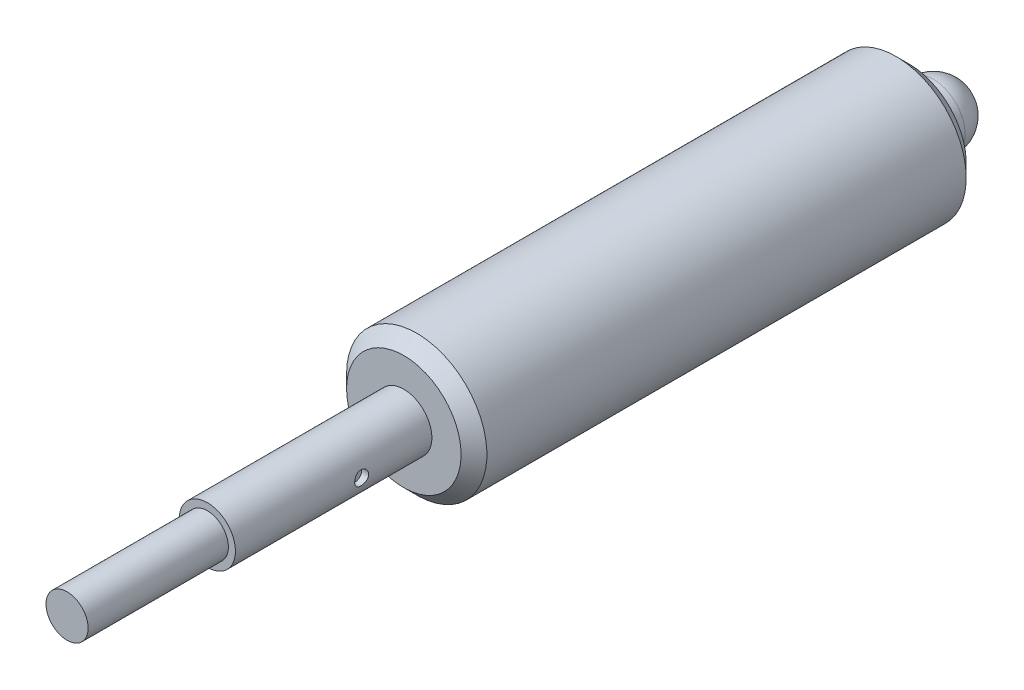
ISO-10303-21;
HEADER;
FILE_DESCRIPTION(('STEP AP214'),'2;1');
FILE_NAME('part.step','',(''),(''),'','','');
FILE_SCHEMA(('AUTOMOTIVE_DESIGN { 1 0 10303 214 1 1 1 1 }'));
ENDSEC;
DATA;
#1=APPLICATION_CONTEXT('core data for automotive mechanical design processes');
#2=APPLICATION_PROTOCOL_DEFINITION('international standard','automotive_design',2000,#1);
#3=PRODUCT_CONTEXT('',#1,'mechanical');
#4=PRODUCT('Part','Part','',(#3));
#5=PRODUCT_RELATED_PRODUCT_CATEGORY('part','',(#4));
#6=PRODUCT_DEFINITION_FORMATION('','',#4);
#7=PRODUCT_DEFINITION_CONTEXT('part definition',#1,'design');
#8=PRODUCT_DEFINITION('design','',#6,#7);
#9=PRODUCT_DEFINITION_SHAPE('','',#8);
#10=(LENGTH_UNIT() NAMED_UNIT(*) SI_UNIT(.MILLI.,.METRE.));
#11=(NAMED_UNIT(*) PLANE_ANGLE_UNIT() SI_UNIT($,.RADIAN.));
#12=(NAMED_UNIT(*) SI_UNIT($,.STERADIAN.) SOLID_ANGLE_UNIT());
#13=UNCERTAINTY_MEASURE_WITH_UNIT(LENGTH_MEASURE(1.E-05),#10,'distance_accuracy_value','');
#14=(GEOMETRIC_REPRESENTATION_CONTEXT(3) GLOBAL_UNCERTAINTY_ASSIGNED_CONTEXT((#13)) GLOBAL_UNIT_ASSIGNED_CONTEXT((#10,
#11,#12)) REPRESENTATION_CONTEXT('',''));
#15=CARTESIAN_POINT('',(0.,0.,0.));
#16=DIRECTION('',(0.,0.,1.));
#17=DIRECTION('',(1.,0.,0.));
#18=AXIS2_PLACEMENT_3D('',#15,#16,#17);
#19=CARTESIAN_POINT('',(0.,0.,60.));
#20=DIRECTION('',(0.,0.,-1.));
#21=DIRECTION('',(-1.,0.,0.));
#22=AXIS2_PLACEMENT_3D('',#19,#20,#21);
#23=PLANE('',#22);
#24=CARTESIAN_POINT('',(0.,0.,60.));
#25=DIRECTION('',(0.,0.,-1.));
#26=DIRECTION('',(-1.,0.,0.));
#27=AXIS2_PLACEMENT_3D('',#24,#25,#26);
#28=CIRCLE('',#27,1.5);
#29=CARTESIAN_POINT('',(-1.5,0.,60.));
#30=VERTEX_POINT('',#29);
#31=EDGE_CURVE('E23',#30,#30,#28,.T.);
#32=ORIENTED_EDGE('',*,*,#31,.F.);
#33=EDGE_LOOP('',(#32));
#34=FACE_BOUND('',#33,.T.);
#35=ADVANCED_FACE('F12',(#34),#23,.F.);
#36=CARTESIAN_POINT('',(0.,0.,5.));
#37=DIRECTION('',(0.,0.,-1.));
#38=DIRECTION('',(-1.,0.,0.));
#39=AXIS2_PLACEMENT_3D('',#36,#37,#38);
#40=CYLINDRICAL_SURFACE('',#39,1.5);
#41=CARTESIAN_POINT('',(0.,0.,50.));
#42=DIRECTION('',(0.,0.,-1.));
#43=DIRECTION('',(-1.,0.,0.));
#44=AXIS2_PLACEMENT_3D('',#41,#42,#43);
#45=CIRCLE('',#44,1.5);
#46=CARTESIAN_POINT('',(-1.5,0.,50.));
#47=VERTEX_POINT('',#46);
#48=EDGE_CURVE('E27',#47,#47,#45,.T.);
#49=ORIENTED_EDGE('',*,*,#48,.F.);
#50=EDGE_LOOP('',(#49));
#51=FACE_BOUND('',#50,.T.);
#52=ORIENTED_EDGE('',*,*,#31,.T.);
#53=EDGE_LOOP('',(#52));
#54=FACE_BOUND('',#53,.T.);
#55=ADVANCED_FACE('F78',(#51,#54),#40,.T.);
#56=CARTESIAN_POINT('',(0.,1.5,50.));
#57=DIRECTION('',(0.,0.,-1.));
#58=DIRECTION('',(-1.,0.,0.));
#59=AXIS2_PLACEMENT_3D('',#56,#57,#58);
#60=PLANE('',#59);
#61=CARTESIAN_POINT('',(0.,0.,50.));
#62=DIRECTION('',(0.,0.,-1.));
#63=DIRECTION('',(-1.,0.,0.));
#64=AXIS2_PLACEMENT_3D('',#61,#62,#63);
#65=CIRCLE('',#64,2.);
#66=CARTESIAN_POINT('',(-2.,0.,50.));
#67=VERTEX_POINT('',#66);
#68=EDGE_CURVE('E31',#67,#67,#65,.T.);
#69=ORIENTED_EDGE('',*,*,#68,.F.);
#70=EDGE_LOOP('',(#69));
#71=FACE_BOUND('',#70,.T.);
#72=ORIENTED_EDGE('',*,*,#48,.T.);
#73=EDGE_LOOP('',(#72));
#74=FACE_BOUND('',#73,.T.);
#75=ADVANCED_FACE('F83',(#71,#74),#60,.F.);
#76=CARTESIAN_POINT('',(0.,0.,5.));
#77=DIRECTION('',(0.,0.,-1.));
#78=DIRECTION('',(-1.,0.,0.));
#79=AXIS2_PLACEMENT_3D('',#76,#77,#78);
#80=CYLINDRICAL_SURFACE('',#79,2.);
#81=CARTESIAN_POINT('',(0.,0.,36.));
#82=DIRECTION('',(0.,0.,-1.));
#83=DIRECTION('',(-1.,0.,0.));
#84=AXIS2_PLACEMENT_3D('',#81,#82,#83);
#85=CIRCLE('',#84,2.);
#86=CARTESIAN_POINT('',(-2.,0.,36.));
#87=VERTEX_POINT('',#86);
#88=EDGE_CURVE('E36',#87,#87,#85,.T.);
#89=ORIENTED_EDGE('',*,*,#88,.F.);
#90=EDGE_LOOP('',(#89));
#91=FACE_BOUND('',#90,.T.);
#92=CARTESIAN_POINT('',(2.,0.,40.5));
#93=CARTESIAN_POINT('',(1.99999953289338,-0.027625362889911,40.5000007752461));
#94=CARTESIAN_POINT('',(1.99942192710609,-0.0552593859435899,40.5022971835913));
#95=CARTESIAN_POINT('',(1.99717371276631,-0.109735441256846,40.511408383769));
#96=CARTESIAN_POINT('',(1.99550248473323,-0.136577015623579,40.5182257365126));
#97=CARTESIAN_POINT('',(1.99125208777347,-0.188673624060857,40.5361464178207));
#98=CARTESIAN_POINT('',(1.98867400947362,-0.213930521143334,40.5472445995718));
#99=CARTESIAN_POINT('',(1.98288447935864,-0.262224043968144,40.5733937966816));
#100=CARTESIAN_POINT('',(1.97967300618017,-0.285260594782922,40.588444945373));
#101=CARTESIAN_POINT('',(1.97289137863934,-0.32893397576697,40.6224002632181));
#102=CARTESIAN_POINT('',(1.96931569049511,-0.349518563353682,40.6413705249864));
#103=CARTESIAN_POINT('',(1.96224540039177,-0.387249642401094,40.682484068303));
#104=CARTESIAN_POINT('',(1.95875080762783,-0.40439574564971,40.7046277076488));
#105=CARTESIAN_POINT('',(1.9521825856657,-0.435008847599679,40.7518650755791));
#106=CARTESIAN_POINT('',(1.94911598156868,-0.44841740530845,40.7769977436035));
#107=CARTESIAN_POINT('',(1.94383164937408,-0.47079896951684,40.8292494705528));
#108=CARTESIAN_POINT('',(1.94161378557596,-0.479772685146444,40.8563682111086));
#109=CARTESIAN_POINT('',(1.93833492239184,-0.492851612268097,40.9112478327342));
#110=CARTESIAN_POINT('',(1.93725163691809,-0.497050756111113,40.9389849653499));
#111=CARTESIAN_POINT('',(1.9362978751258,-0.500753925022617,40.9947895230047));
#112=CARTESIAN_POINT('',(1.93642720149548,-0.500258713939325,41.0228568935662));
#113=CARTESIAN_POINT('',(1.93786401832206,-0.494662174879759,41.0778052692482));
#114=CARTESIAN_POINT('',(1.93914287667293,-0.489672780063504,41.1046985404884));
#115=CARTESIAN_POINT('',(1.94268903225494,-0.475408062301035,41.1572536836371));
#116=CARTESIAN_POINT('',(1.94495639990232,-0.466132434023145,41.1829154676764));
#117=CARTESIAN_POINT('',(1.95025037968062,-0.443463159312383,41.2325793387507));
#118=CARTESIAN_POINT('',(1.95328442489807,-0.430028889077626,41.2565620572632));
#119=CARTESIAN_POINT('',(1.95976570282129,-0.399452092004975,41.3019729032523));
#120=CARTESIAN_POINT('',(1.96321300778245,-0.382308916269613,41.3234005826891));
#121=CARTESIAN_POINT('',(1.9702529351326,-0.34422114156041,41.3637345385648));
#122=CARTESIAN_POINT('',(1.97384689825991,-0.323182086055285,41.3825514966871));
#123=CARTESIAN_POINT('',(1.98068655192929,-0.278203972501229,41.4164070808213));
#124=CARTESIAN_POINT('',(1.98393223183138,-0.254264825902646,41.4314455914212));
#125=CARTESIAN_POINT('',(1.98972577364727,-0.204038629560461,41.4573501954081));
#126=CARTESIAN_POINT('',(1.99227120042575,-0.177743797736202,41.4682017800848));
#127=CARTESIAN_POINT('',(1.99635972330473,-0.123625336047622,41.4853057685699));
#128=CARTESIAN_POINT('',(1.99790301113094,-0.095801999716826,41.4915590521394));
#129=CARTESIAN_POINT('',(1.99978499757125,-0.0401799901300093,41.499152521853));
#130=CARTESIAN_POINT('',(2.00015351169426,-0.0123989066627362,41.5006143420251));
#131=CARTESIAN_POINT('',(1.9997293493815,0.0430109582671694,41.4989169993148));
#132=CARTESIAN_POINT('',(1.99893677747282,0.0706397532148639,41.4957582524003));
#133=CARTESIAN_POINT('',(1.99629860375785,0.124538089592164,41.4850096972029));
#134=CARTESIAN_POINT('',(1.99446878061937,0.15082170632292,41.4774862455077));
#135=CARTESIAN_POINT('',(1.98996235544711,0.201752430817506,41.4582976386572));
#136=CARTESIAN_POINT('',(1.98728566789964,0.22639937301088,41.446632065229));
#137=CARTESIAN_POINT('',(1.98131102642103,0.273841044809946,41.4192546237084));
#138=CARTESIAN_POINT('',(1.97800289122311,0.296595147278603,41.4034746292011));
#139=CARTESIAN_POINT('',(1.97114836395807,0.339175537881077,41.3684033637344));
#140=CARTESIAN_POINT('',(1.96760193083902,0.35900131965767,41.3491114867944));
#141=CARTESIAN_POINT('',(1.96056318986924,0.395663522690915,41.3069993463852));
#142=CARTESIAN_POINT('',(1.95707434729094,0.412414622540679,41.2841040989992));
#143=CARTESIAN_POINT('',(1.95064292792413,0.441836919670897,41.2357557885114));
#144=CARTESIAN_POINT('',(1.94770032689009,0.454508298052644,41.2103028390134));
#145=CARTESIAN_POINT('',(1.94272698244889,0.475317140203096,41.157698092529));
#146=CARTESIAN_POINT('',(1.94069085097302,0.483481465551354,41.1305574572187));
#147=CARTESIAN_POINT('',(1.93775581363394,0.495115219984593,41.0752301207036));
#148=CARTESIAN_POINT('',(1.93685665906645,0.498585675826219,41.0470436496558));
#149=CARTESIAN_POINT('',(1.93631633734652,0.500679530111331,40.9912929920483));
#150=CARTESIAN_POINT('',(1.93663977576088,0.49943929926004,40.9637341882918));
#151=CARTESIAN_POINT('',(1.93842636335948,0.492459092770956,40.9092320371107));
#152=CARTESIAN_POINT('',(1.93988948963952,0.486719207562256,40.8822886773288));
#153=CARTESIAN_POINT('',(1.94377086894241,0.470977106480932,40.8299305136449));
#154=CARTESIAN_POINT('',(1.94618338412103,0.461000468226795,40.8045075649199));
#155=CARTESIAN_POINT('',(1.95169251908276,0.437088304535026,40.7556782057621));
#156=CARTESIAN_POINT('',(1.95478923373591,0.423152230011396,40.7322720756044));
#157=CARTESIAN_POINT('',(1.96141878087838,0.391289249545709,40.6874817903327));
#158=CARTESIAN_POINT('',(1.96496088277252,0.373267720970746,40.6661663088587));
#159=CARTESIAN_POINT('',(1.97202675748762,0.333929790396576,40.6268176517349));
#160=CARTESIAN_POINT('',(1.97555052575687,0.31261260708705,40.608785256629));
#161=CARTESIAN_POINT('',(1.98225885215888,0.266822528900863,40.5761962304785));
#162=CARTESIAN_POINT('',(1.98543611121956,0.242299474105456,40.5617084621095));
#163=CARTESIAN_POINT('',(1.99101641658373,0.191088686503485,40.5370841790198));
#164=CARTESIAN_POINT('',(1.99342001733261,0.164402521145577,40.5269445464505));
#165=CARTESIAN_POINT('',(1.99682686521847,0.114803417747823,40.5128093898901));
#166=CARTESIAN_POINT('',(1.9980086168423,0.0921267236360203,40.5080162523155));
#167=CARTESIAN_POINT('',(1.99959535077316,0.0463020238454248,40.501611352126));
#168=CARTESIAN_POINT('',(2.00000039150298,0.0231540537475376,40.4999993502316));
#169=CARTESIAN_POINT('',(2.,0.,40.5));
#170=B_SPLINE_CURVE_WITH_KNOTS('',3,(#92,#93,#94,#95,#96,#97,#98,#99,#100,#101,#102,#103,#104,
#105,#106,#107,#108,#109,#110,#111,#112,#113,#114,#115,#116,#117,#118,#119,#120,#121,#122,#123,
#124,#125,#126,#127,#128,#129,#130,#131,#132,#133,#134,#135,#136,#137,#138,#139,#140,#141,#142,
#143,#144,#145,#146,#147,#148,#149,#150,#151,#152,#153,#154,#155,#156,#157,#158,#159,#160,#161,
#162,#163,#164,#165,#166,#167,#168,#169),.UNSPECIFIED.,.T.,.F.,(4,2,2,2,2,2,2,2,2,2,2,2,2,2,2,2,
2,2,2,2,2,2,2,2,2,2,2,2,2,2,2,2,2,2,2,2,2,2,4),(0.,0.0827912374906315,0.165629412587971,
0.248368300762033,0.331109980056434,0.415381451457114,0.499662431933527,0.585195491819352,
0.670714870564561,0.754520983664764,0.838313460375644,0.920074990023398,1.00184234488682,
1.08443509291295,1.16704230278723,1.25200500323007,1.33697029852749,1.42222743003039,
1.50746824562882,1.59052769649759,1.67357967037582,1.7554009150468,1.83723042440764,
1.92051195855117,2.00380787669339,2.08914836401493,2.17448506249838,2.25930751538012,
2.34411141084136,2.42647926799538,2.50884546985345,2.59072133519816,2.67260856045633,
2.75663192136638,2.84067523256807,2.92624061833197,3.01174454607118,3.08114080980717,
3.1505318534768),.UNSPECIFIED.);
#171=CARTESIAN_POINT('',(2.,0.,40.5));
#172=VERTEX_POINT('',#171);
#173=EDGE_CURVE('E8',#172,#172,#170,.T.);
#174=ORIENTED_EDGE('',*,*,#173,.T.);
#175=EDGE_LOOP('',(#174));
#176=FACE_BOUND('',#175,.T.);
#177=ORIENTED_EDGE('',*,*,#68,.T.);
#178=EDGE_LOOP('',(#177));
#179=FACE_BOUND('',#178,.T.);
#180=ADVANCED_FACE('F88',(#91,#176,#179),#80,.T.);
#181=CARTESIAN_POINT('',(0.,2.,36.));
#182=DIRECTION('',(0.,0.,-1.));
#183=DIRECTION('',(-1.,0.,0.));
#184=AXIS2_PLACEMENT_3D('',#181,#182,#183);
#185=PLANE('',#184);
#186=CARTESIAN_POINT('',(0.,0.,36.));
#187=DIRECTION('',(0.,0.,-1.));
#188=DIRECTION('',(-1.,0.,0.));
#189=AXIS2_PLACEMENT_3D('',#186,#187,#188);
#190=CIRCLE('',#189,4.08);
#191=CARTESIAN_POINT('',(-4.08,0.,36.));
#192=VERTEX_POINT('',#191);
#193=EDGE_CURVE('E39',#192,#192,#190,.T.);
#194=ORIENTED_EDGE('',*,*,#193,.F.);
#195=EDGE_LOOP('',(#194));
#196=FACE_BOUND('',#195,.T.);
#197=ORIENTED_EDGE('',*,*,#88,.T.);
#198=EDGE_LOOP('',(#197));
#199=FACE_BOUND('',#198,.T.);
#200=ADVANCED_FACE('F95',(#196,#199),#185,.F.);
#201=CARTESIAN_POINT('',(0.,0.,36.));
#202=DIRECTION('',(0.,0.,-1.));
#203=DIRECTION('',(-1.,0.,0.));
#204=AXIS2_PLACEMENT_3D('',#201,#202,#203);
#205=CONICAL_SURFACE('',#204,4.08,0.785398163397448);
#206=CARTESIAN_POINT('',(0.,0.,35.08));
#207=DIRECTION('',(0.,0.,-1.));
#208=DIRECTION('',(-1.,0.,0.));
#209=AXIS2_PLACEMENT_3D('',#206,#207,#208);
#210=CIRCLE('',#209,5.);
#211=CARTESIAN_POINT('',(-5.,0.,35.08));
#212=VERTEX_POINT('',#211);
#213=EDGE_CURVE('E42',#212,#212,#210,.T.);
#214=ORIENTED_EDGE('',*,*,#213,.F.);
#215=EDGE_LOOP('',(#214));
#216=FACE_BOUND('',#215,.T.);
#217=ORIENTED_EDGE('',*,*,#193,.T.);
#218=EDGE_LOOP('',(#217));
#219=FACE_BOUND('',#218,.T.);
#220=ADVANCED_FACE('F99',(#216,#219),#205,.T.);
#221=CARTESIAN_POINT('',(0.,0.,5.));
#222=DIRECTION('',(0.,0.,-1.));
#223=DIRECTION('',(-1.,0.,0.));
#224=AXIS2_PLACEMENT_3D('',#221,#222,#223);
#225=CYLINDRICAL_SURFACE('',#224,5.);
#226=CARTESIAN_POINT('',(0.,0.,0.92));
#227=DIRECTION('',(0.,0.,-1.));
#228=DIRECTION('',(-1.,0.,0.));
#229=AXIS2_PLACEMENT_3D('',#226,#227,#228);
#230=CIRCLE('',#229,5.);
#231=CARTESIAN_POINT('',(-5.,0.,0.92));
#232=VERTEX_POINT('',#231);
#233=EDGE_CURVE('E45',#232,#232,#230,.T.);
#234=ORIENTED_EDGE('',*,*,#233,.F.);
#235=EDGE_LOOP('',(#234));
#236=FACE_BOUND('',#235,.T.);
#237=ORIENTED_EDGE('',*,*,#213,.T.);
#238=EDGE_LOOP('',(#237));
#239=FACE_BOUND('',#238,.T.);
#240=ADVANCED_FACE('F103',(#236,#239),#225,.T.);
#241=CARTESIAN_POINT('',(0.,0.,0.92));
#242=DIRECTION('',(0.,0.,1.));
#243=DIRECTION('',(1.,0.,0.));
#244=AXIS2_PLACEMENT_3D('',#241,#242,#243);
#245=CONICAL_SURFACE('',#244,5.,0.785398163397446);
#246=CARTESIAN_POINT('',(0.,0.,0.));
#247=DIRECTION('',(0.,0.,-1.));
#248=DIRECTION('',(-1.,0.,0.));
#249=AXIS2_PLACEMENT_3D('',#246,#247,#248);
#250=CIRCLE('',#249,4.08);
#251=CARTESIAN_POINT('',(-4.08,0.,0.));
#252=VERTEX_POINT('',#251);
#253=EDGE_CURVE('E48',#252,#252,#250,.T.);
#254=ORIENTED_EDGE('',*,*,#253,.F.);
#255=EDGE_LOOP('',(#254));
#256=FACE_BOUND('',#255,.T.);
#257=ORIENTED_EDGE('',*,*,#233,.T.);
#258=EDGE_LOOP('',(#257));
#259=FACE_BOUND('',#258,.T.);
#260=ADVANCED_FACE('F107',(#256,#259),#245,.T.);
#261=CARTESIAN_POINT('',(0.,4.08,0.));
#262=DIRECTION('',(0.,0.,1.));
#263=DIRECTION('',(1.,0.,0.));
#264=AXIS2_PLACEMENT_3D('',#261,#262,#263);
#265=PLANE('',#264);
#266=CARTESIAN_POINT('',(0.,0.,0.));
#267=DIRECTION('',(0.,0.,-1.));
#268=DIRECTION('',(-1.,0.,0.));
#269=AXIS2_PLACEMENT_3D('',#266,#267,#268);
#270=CIRCLE('',#269,2.25);
#271=CARTESIAN_POINT('',(-2.25,0.,0.));
#272=VERTEX_POINT('',#271);
#273=EDGE_CURVE('E51',#272,#272,#270,.T.);
#274=ORIENTED_EDGE('',*,*,#273,.F.);
#275=EDGE_LOOP('',(#274));
#276=FACE_BOUND('',#275,.T.);
#277=ORIENTED_EDGE('',*,*,#253,.T.);
#278=EDGE_LOOP('',(#277));
#279=FACE_BOUND('',#278,.T.);
#280=ADVANCED_FACE('F111',(#276,#279),#265,.F.);
#281=CARTESIAN_POINT('',(0.,0.,-4.));
#282=DIRECTION('',(0.,0.,-1.));
#283=DIRECTION('',(-1.,0.,0.));
#284=AXIS2_PLACEMENT_3D('',#281,#282,#283);
#285=CYLINDRICAL_SURFACE('',#284,2.25);
#286=CARTESIAN_POINT('',(0.,0.,-1.75));
#287=DIRECTION('',(0.,0.,-1.));
#288=DIRECTION('',(-1.,0.,0.));
#289=AXIS2_PLACEMENT_3D('',#286,#287,#288);
#290=CIRCLE('',#289,2.25);
#291=CARTESIAN_POINT('',(-2.25,0.,-1.75));
#292=VERTEX_POINT('',#291);
#293=EDGE_CURVE('E54',#292,#292,#290,.T.);
#294=ORIENTED_EDGE('',*,*,#293,.F.);
#295=EDGE_LOOP('',(#294));
#296=FACE_BOUND('',#295,.T.);
#297=ORIENTED_EDGE('',*,*,#273,.T.);
#298=EDGE_LOOP('',(#297));
#299=FACE_BOUND('',#298,.T.);
#300=ADVANCED_FACE('F73',(#296,#299),#285,.T.);
#301=CARTESIAN_POINT('',(0.,0.,-1.75));
#302=DIRECTION('',(0.,0.,-1.));
#303=DIRECTION('',(0.,1.,0.));
#304=AXIS2_PLACEMENT_3D('',#301,#302,#303);
#305=SPHERICAL_SURFACE('',#304,2.25);
#306=ORIENTED_EDGE('',*,*,#293,.T.);
#307=EDGE_LOOP('',(#306));
#308=FACE_BOUND('',#307,.T.);
#309=ADVANCED_FACE('F66',(#308),#305,.T.);
#310=CARTESIAN_POINT('',(1.5,0.,41.));
#311=DIRECTION('',(1.,0.,0.));
#312=DIRECTION('',(0.,0.,-1.));
#313=AXIS2_PLACEMENT_3D('',#310,#311,#312);
#314=CYLINDRICAL_SURFACE('',#313,0.5);
#315=CARTESIAN_POINT('',(1.5,0.,41.));
#316=DIRECTION('',(1.,0.,0.));
#317=DIRECTION('',(0.,0.,-1.));
#318=AXIS2_PLACEMENT_3D('',#315,#316,#317);
#319=CIRCLE('',#318,0.5);
#320=CARTESIAN_POINT('',(1.5,0.,40.5));
#321=VERTEX_POINT('',#320);
#322=EDGE_CURVE('E57',#321,#321,#319,.T.);
#323=ORIENTED_EDGE('',*,*,#322,.F.);
#324=EDGE_LOOP('',(#323));
#325=FACE_BOUND('',#324,.T.);
#326=ORIENTED_EDGE('',*,*,#173,.F.);
#327=EDGE_LOOP('',(#326));
#328=FACE_BOUND('',#327,.T.);
#329=ADVANCED_FACE('F63',(#325,#328),#314,.F.);
#330=CARTESIAN_POINT('',(1.5,0.,41.));
#331=DIRECTION('',(1.,0.,0.));
#332=DIRECTION('',(0.,0.,-1.));
#333=AXIS2_PLACEMENT_3D('',#330,#331,#332);
#334=PLANE('',#333);
#335=ORIENTED_EDGE('',*,*,#322,.T.);
#336=EDGE_LOOP('',(#335));
#337=FACE_BOUND('',#336,.T.);
#338=ADVANCED_FACE('F61',(#337),#334,.T.);
#339=CLOSED_SHELL('',(#35,#55,#75,#180,#200,#220,#240,#260,#280,#300,#309,#329,#338));
#340=MANIFOLD_SOLID_BREP('B1',#339);
#341=ADVANCED_BREP_SHAPE_REPRESENTATION('',(#18,#340),#14);
#342=SHAPE_DEFINITION_REPRESENTATION(#9,#341);
ENDSEC;
END-ISO-10303-21;
